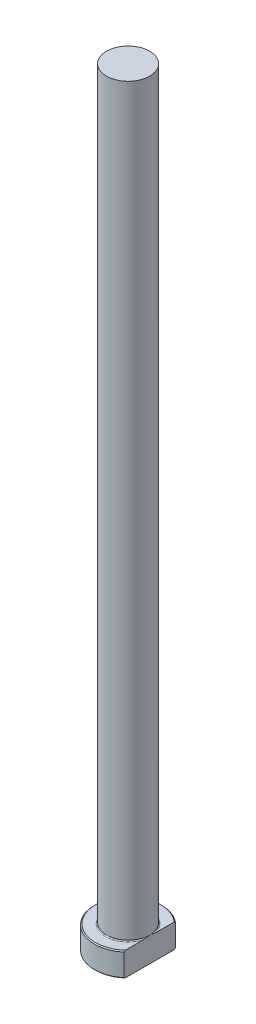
from build123d import *
from build123d.topology import SkipClean

# Parameters (mm, degrees)
CHAMFER1_SIZE = 0.2
FILLET1_R     = 0.2
KEY_DEPTH     = 161.305957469


with BuildPart() as part:
    # Sketch1 → Revolve1 (revolve)
    with BuildSketch(Plane.XY, mode=Mode.PRIVATE) as revolve1_sk:
        Polygon((0, 0), (-7, 0), (-7, 5), (-4.5, 5), (-4.5, 160), (0, 160), align=None)
    revolve(revolve1_sk.sketch.rotate(Axis((0, 259.958771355, 0), (0, -1, 0)), 270), axis=Axis((0, 259.958771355, 0), (0, -1, 0)))

    # Chamfer1
    chamfer1_edges = [part.edges().sort_by_distance(p)[0] for p in [
        (0, 5, -7),
        (0, 0, -7),
    ]]
    chamfer(chamfer1_edges, length=CHAMFER1_SIZE)

    # Fillet1
    fillet1_edges = [part.edges().sort_by_distance(p)[0] for p in [
        (0, 5, -4.5),
    ]]
    fillet(fillet1_edges, radius=FILLET1_R)

    # Sketch2 → KEY (cut, through all)
    with SkipClean():  # the faces are left unmerged after this step: merging them gives an invalid solid
        with BuildSketch(Plane(origin=(0, 0, 0), x_dir=(1, 0, 0), z_dir=(0, 1, 0))):
            with BuildLine():
                Line((4.5, 5.361902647), (4.5, -5.361902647))
                ThreePointArc((4.5, -5.361902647), (7, 0), (4.5, 5.361902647))
            make_face()
        extrude(amount=KEY_DEPTH, mode=Mode.SUBTRACT)


solid = part.part
